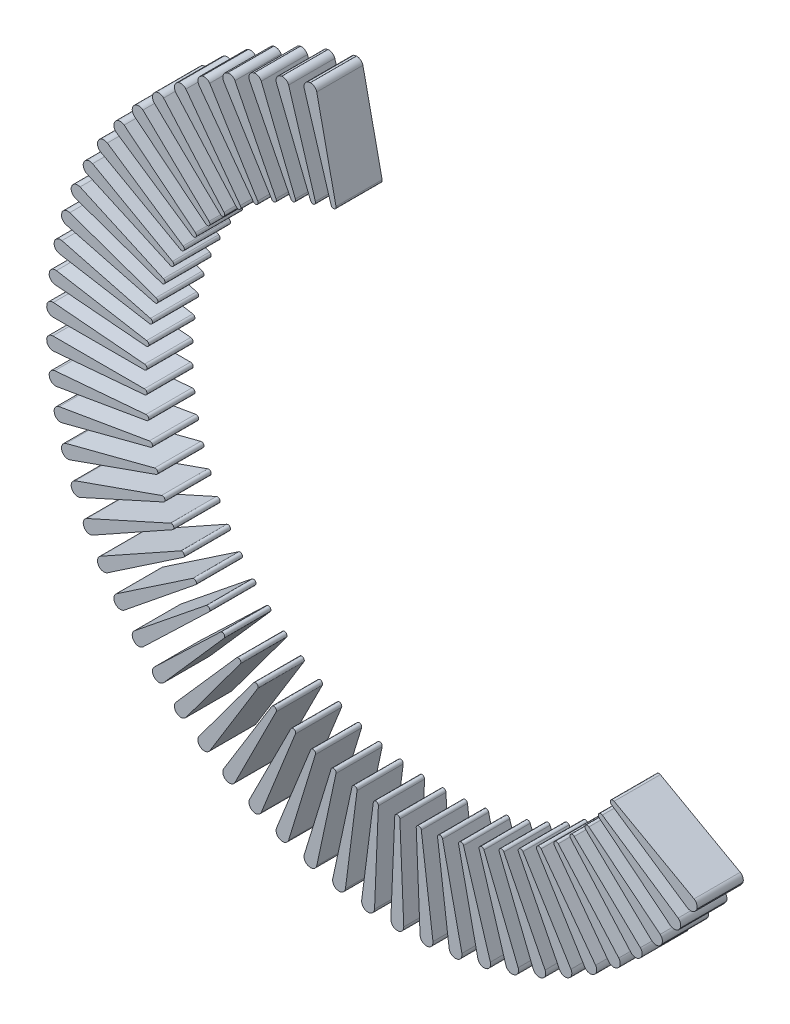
from build123d import *

# Parameters (mm, degrees)
P_IDAT_VYSUNUT_M1_DEPTH  = 10
M_TKO1_SCALE             = 0.655
ODEBRAT_VYSUNUT_M1_DEPTH = 71.666349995


with BuildPart() as part:
    # Skica1 → P_idat vysunut_m1 (new body)
    with BuildSketch(Plane.XY):
        with BuildLine():
            Line((0.319329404, 75.987034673), (-0.000670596, 75.987034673))
            Line((-0.000670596, 75.987034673), (-0.320670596, 75.987034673))
            Line((-0.320670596, 75.987034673), (-0.320670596, 75.977034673))
            ThreePointArc((-0.320670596, 75.977034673), (-1.097939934, 75.483579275), (-1.400670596, 74.61409667))
            Line((-1.400670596, 74.61409667), (-0.550670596, 54.81409667))
            ThreePointArc((-0.550670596, 54.81409667), (-0.000670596, 54.26409667), (0.549329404, 54.81409667))
            Line((0.549329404, 54.81409667), (1.399329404, 74.61409667))
            ThreePointArc((1.399329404, 74.61409667), (1.096598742, 75.483579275), (0.319329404, 75.977034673))
            Line((0.319329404, 75.977034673), (0.319329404, 75.987034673))
        make_face()
        with BuildLine():
            ThreePointArc((6.123787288, 75.730521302), (5.30747013, 75.304760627), (4.932092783, 74.464083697))
            Line((4.932092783, 74.464083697), (4.099873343, 54.663328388))
            ThreePointArc((4.099873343, 54.663328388), (4.601248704, 54.068666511), (5.195910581, 54.570041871))
            Line((5.195910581, 54.570041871), (7.722005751, 74.226627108))
            ThreePointArc((7.722005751, 74.226627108), (7.494102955, 75.118650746), (6.76148168, 75.67624551))
            Line((6.76148168, 75.67624551), (6.76232974, 75.686209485))
            Line((6.76232974, 75.686209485), (6.124635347, 75.740485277))
            Line((6.124635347, 75.740485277), (6.123787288, 75.730521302))
        make_face()
        with BuildLine():
            ThreePointArc((12.524123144, 74.938367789), (11.674639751, 74.583369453), (11.22932032, 73.777555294))
            Line((11.22932032, 73.777555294), (8.720877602, 54.118709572))
            ThreePointArc((8.720877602, 54.118709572), (9.170015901, 53.48367037), (9.805055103, 53.93280867))
            Line((9.805055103, 53.93280867), (13.989044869, 73.304352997))
            ThreePointArc((13.989044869, 73.304352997), (13.837611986, 74.212490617), (13.154917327, 74.830207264))
            Line((13.154917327, 74.830207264), (13.156607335, 74.840063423))
            Line((13.156607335, 74.840063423), (12.525813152, 74.948223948))
            Line((12.525813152, 74.948223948), (12.524123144, 74.938367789))
        make_face()
        with BuildLine():
            ThreePointArc((18.834222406, 73.606281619), (17.957693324, 73.324603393), (17.445640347, 72.559457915))
            Line((17.445640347, 72.559457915), (13.279047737, 53.184164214))
            ThreePointArc((13.279047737, 53.184164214), (13.672712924, 52.513323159), (14.343553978, 52.906988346))
            Line((14.343553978, 52.906988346), (20.155292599, 71.853919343))
            ThreePointArc((20.155292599, 71.853919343), (20.081420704, 72.771627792), (19.453571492, 73.44501566))
            Line((19.453571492, 73.44501566), (19.456091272, 73.454692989))
            Line((19.456091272, 73.454692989), (18.836742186, 73.615958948))
            Line((18.836742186, 73.615958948), (18.834222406, 73.606281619))
        make_face()
        with BuildLine():
            ThreePointArc((25.008620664, 71.743860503), (24.111361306, 71.537531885), (23.536264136, 70.818567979))
            Line((23.536264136, 70.818567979), (17.741542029, 51.866425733))
            ThreePointArc((17.741542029, 51.866425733), (18.076897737, 51.164616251), (18.778707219, 51.499971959))
            Line((18.778707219, 51.499971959), (26.176320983, 69.885776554))
            ThreePointArc((26.176320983, 69.885776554), (26.180542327, 70.806443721), (25.612062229, 71.530651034))
            Line((25.612062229, 71.530651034), (25.615393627, 71.540079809))
            Line((25.615393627, 71.540079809), (25.011952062, 71.753289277))
            Line((25.011952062, 71.753289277), (25.008620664, 71.743860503))
        make_face()
        with BuildLine():
            ThreePointArc((31.002831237, 69.364523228), (30.091306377, 69.235030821), (29.457308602, 68.567428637))
            Line((29.457308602, 68.567428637), (22.076208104, 50.174988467))
            ThreePointArc((22.076208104, 50.174988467), (22.350838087, 49.447267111), (23.078559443, 49.721897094))
            Line((23.078559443, 49.721897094), (32.008748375, 67.414105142))
            ThreePointArc((32.008748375, 67.414105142), (32.091032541, 68.331097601), (31.58601747, 69.100906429))
            Line((31.58601747, 69.100906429), (31.590136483, 69.110018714))
            Line((31.590136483, 69.110018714), (31.006950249, 69.373635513))
            Line((31.006950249, 69.373635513), (31.002831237, 69.364523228))
        make_face()
        with BuildLine():
            ThreePointArc((36.7736657, 66.485412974), (35.854442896, 66.433689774), (35.166112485, 65.822259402))
            Line((35.166112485, 65.822259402), (26.251814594, 48.122039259))
            ThreePointArc((26.251814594, 48.122039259), (26.463740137, 47.373649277), (27.212130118, 47.585574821))
            Line((27.212130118, 47.585574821), (37.610552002, 64.456713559))
            ThreePointArc((37.610552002, 64.456713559), (37.770306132, 65.363424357), (37.332394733, 66.17328821))
            Line((37.332394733, 66.17328821), (37.337271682, 66.182018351))
            Line((37.337271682, 66.182018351), (36.77854265, 66.494143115))
            Line((36.77854265, 66.494143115), (36.7736657, 66.485412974))
        make_face()
        with BuildLine():
            ThreePointArc((42.279545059, 63.127273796), (41.359247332, 63.153692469), (40.621543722, 62.602839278))
            Line((40.621543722, 62.602839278), (30.238276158, 45.722369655))
            ThreePointArc((30.238276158, 45.722369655), (30.385970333, 44.958703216), (31.149636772, 45.10639739))
            Line((31.149636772, 45.10639739), (42.941370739, 61.034909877))
            ThreePointArc((42.941370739, 61.034909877), (43.1774438, 61.924806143), (42.809791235, 62.768889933))
            Line((42.809791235, 62.768889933), (42.815390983, 62.77717503))
            Line((42.815390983, 62.77717503), (42.285144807, 63.135558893))
            Line((42.285144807, 63.135558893), (42.279545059, 63.127273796))
        make_face()
        with BuildLine():
            ThreePointArc((47.480799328, 59.314301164), (46.566057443, 59.418671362), (45.784295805, 58.932364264))
            Line((45.784295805, 58.932364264), (34.006870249, 42.993269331))
            ThreePointArc((34.006870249, 42.993269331), (34.089268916, 42.219828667), (34.862709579, 42.302227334))
            Line((34.862709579, 42.302227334), (47.962795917, 57.173348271))
            ThreePointArc((47.962795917, 57.173348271), (48.273486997, 58.040018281), (47.978742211, 58.912240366))
            Line((47.978742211, 58.912240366), (47.985024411, 58.920020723))
            Line((47.985024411, 58.920020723), (47.487081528, 59.322081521))
            Line((47.487081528, 59.322081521), (47.480799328, 59.314301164))
        make_face()
        with BuildLine():
            ThreePointArc((52.339953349, 55.073967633), (51.437358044, 55.255537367), (50.617170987, 54.837280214))
            Line((50.617170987, 54.837280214), (37.530444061, 39.954401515))
            ThreePointArc((37.530444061, 39.954401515), (37.546953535, 39.176759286), (38.324595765, 39.193268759))
            Line((38.324595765, 39.193268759), (52.63864805, 52.899851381))
            ThreePointArc((52.63864805, 52.899851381), (53.021718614, 53.737050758), (52.802005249, 54.631126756))
            Line((52.802005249, 54.631126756), (52.808924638, 54.638346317))
            Line((52.808924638, 54.638346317), (52.346872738, 55.081187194))
            Line((52.346872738, 55.081187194), (52.339953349, 55.073967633))
        make_face()
        with BuildLine():
            ThreePointArc((56.821996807, 50.436824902), (55.938051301, 50.694285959), (55.085348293, 50.347092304))
            Line((55.085348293, 50.347092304), (40.783610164, 36.627661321))
            ThreePointArc((40.783610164, 36.627661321), (40.734111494, 35.851420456), (41.51035236, 35.801921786))
            Line((41.51035236, 35.801921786), (56.935237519, 48.245209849))
            ThreePointArc((56.935237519, 48.245209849), (57.387927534, 49.046906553), (57.24482863, 49.956394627))
            Line((57.24482863, 49.956394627), (57.252335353, 49.963001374))
            Line((57.252335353, 49.963001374), (56.82950353, 50.44343165))
            Line((56.82950353, 50.44343165), (56.821996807, 50.436824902))
        make_face()
        with BuildLine():
            ThreePointArc((60.894636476, 45.436283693), (60.035709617, 45.767781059), (59.156634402, 45.49415244))
            Line((59.156634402, 45.49415244), (43.742929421, 33.037017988))
            ThreePointArc((43.742929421, 33.037017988), (43.627779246, 32.26777132), (44.397025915, 32.152621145))
            Line((44.397025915, 32.152621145), (60.821607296, 43.242960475))
            ThreePointArc((60.821607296, 43.242960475), (61.34065512, 44.003378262), (61.275201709, 44.92172553))
            Line((61.275201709, 44.92172553), (61.28324168, 44.927671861))
            Line((61.28324168, 44.927671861), (60.902676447, 45.442230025))
            Line((60.902676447, 45.442230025), (60.894636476, 45.436283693))
        make_face()
        with BuildLine():
            ThreePointArc((64.528528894, 40.108373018), (63.700809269, 40.511518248), (62.801695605, 40.313426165))
            Line((62.801695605, 40.313426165), (46.387079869, 29.208342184))
            ThreePointArc((46.387079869, 29.208342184), (46.207107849, 28.451632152), (46.963817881, 28.271660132))
            Line((46.963817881, 28.271660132), (64.269755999, 37.92914458))
            ThreePointArc((64.269755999, 37.92914458), (64.851421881, 38.642804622), (64.864085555, 39.56339437))
            Line((64.864085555, 39.56339437), (64.872600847, 39.568637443))
            Line((64.872600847, 39.568637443), (64.537044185, 40.113616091))
            Line((64.537044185, 40.113616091), (64.528528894, 40.108373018))
        make_face()
        with BuildLine():
            ThreePointArc((67.697491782, 34.491480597), (66.906943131, 34.96336902), (65.994269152, 34.842240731))
            Line((65.994269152, 34.842240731), (48.697010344, 25.169219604))
            ThreePointArc((48.697010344, 25.169219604), (48.453513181, 24.430498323), (49.192234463, 24.18700116))
            Line((49.192234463, 24.18700116), (67.254839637, 32.342048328))
            ThreePointArc((67.254839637, 32.342048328), (67.894932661, 33.003808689), (67.985622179, 33.920008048))
            Line((67.985622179, 33.920008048), (67.994551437, 33.924510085))
            Line((67.994551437, 33.924510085), (67.706421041, 34.495982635))
            Line((67.706421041, 34.495982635), (67.697491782, 34.491480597))
        make_face()
        with BuildLine():
            ThreePointArc((70.378692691, 28.626076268), (69.631010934, 29.163307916), (68.711352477, 29.120016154))
            Line((68.711352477, 29.120016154), (50.656077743, 20.948752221))
            ThreePointArc((50.656077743, 20.948752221), (50.35080984, 20.233342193), (51.066219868, 19.928074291))
            Line((51.066219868, 19.928074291), (69.755350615, 26.521926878))
            ThreePointArc((69.755350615, 26.521926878), (70.449258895, 27.127019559), (70.617320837, 28.03222729))
            Line((70.617320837, 28.03222729), (70.626599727, 28.035955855))
            Line((70.626599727, 28.035955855), (70.387971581, 28.629804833))
            Line((70.387971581, 28.629804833), (70.378692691, 28.626076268))
        make_face()
        with BuildLine():
            ThreePointArc((72.552813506, 22.554420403), (71.853385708, 23.153124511), (70.933368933, 23.187981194))
            Line((70.933368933, 23.187981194), (52.250166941, 16.577348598))
            ThreePointArc((52.250166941, 16.577348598), (51.885327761, 15.890404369), (52.572271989, 15.52556519))
            Line((52.572271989, 15.52556519), (71.753272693, 20.510714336))
            ThreePointArc((71.753272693, 20.510714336), (72.495996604, 21.054779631), (72.74022008, 21.942473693))
            Line((72.74022008, 21.942473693), (72.749781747, 21.945401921))
            Line((72.749781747, 21.945401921), (72.562375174, 22.557348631))
            Line((72.562375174, 22.557348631), (72.552813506, 22.554420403))
        make_face()
        with BuildLine():
            ThreePointArc((74.204189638, 16.320259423), (73.558055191, 16.976122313), (72.644308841, 17.088876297))
            Line((72.644308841, 17.088876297), (53.467792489, 12.086504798))
            ThreePointArc((53.467792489, 12.086504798), (53.046010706, 11.432975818), (53.699539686, 11.011194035))
            Line((53.699539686, 11.011194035), (73.234210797, 14.351721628))
            ThreePointArc((73.234210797, 14.351721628), (74.020398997, 14.830839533), (74.33902437, 15.69462407))
            Line((74.33902437, 15.69462407), (74.348799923, 15.696730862))
            Line((74.348799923, 15.696730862), (74.21396519, 16.322366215))
            Line((74.21396519, 16.322366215), (74.204189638, 16.320259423))
        make_face()
        with BuildLine():
            ThreePointArc((75.320922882, 9.968510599), (74.732737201, 10.676806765), (73.831844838, 10.866645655))
            Line((73.831844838, 10.866645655), (54.300181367, 7.508577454))
            ThreePointArc((54.300181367, 7.508577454), (53.824495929, 6.893172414), (54.439900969, 6.417486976))
            Line((54.439900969, 6.417486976), (74.187494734, 8.089324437))
            ThreePointArc((74.187494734, 8.089324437), (75.011482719, 8.500042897), (75.402214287, 9.33369432))
            Line((75.402214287, 9.33369432), (75.412133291, 9.334964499))
            Line((75.412133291, 9.334964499), (75.330841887, 9.969780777))
            Line((75.330841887, 9.969780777), (75.320922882, 9.968510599))
        make_face()
        with BuildLine():
            ThreePointArc((75.894967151, 3.544938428), (75.368968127, 4.300564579), (74.487420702, 4.566120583))
            Line((74.487420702, 4.566120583), (54.741336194, 2.876550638))
            ThreePointArc((54.741336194, 2.876550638), (54.215174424, 2.303703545), (54.788021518, 1.777541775))
            Line((54.788021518, 1.777541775), (74.606256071, 1.768643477))
            ThreePointArc((74.606256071, 1.768643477), (75.462106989, 2.108003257), (75.922129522, 2.905515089))
            Line((75.922129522, 2.905515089), (75.932120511, 2.905939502))
            Line((75.932120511, 2.905939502), (75.904958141, 3.54536284))
            Line((75.904958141, 3.54536284), (75.894967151, 3.544938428))
        make_face()
        with BuildLine():
            ThreePointArc((75.922186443, -2.904175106), (75.462163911, -2.106663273), (74.606312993, -1.767303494))
            Line((74.606312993, -1.767303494), (54.788078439, -1.776201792))
            ThreePointArc((54.788078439, -1.776201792), (54.215231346, -2.302363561), (54.741393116, -2.875210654))
            Line((54.741393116, -2.875210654), (74.487477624, -4.564780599))
            ThreePointArc((74.487477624, -4.564780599), (75.369025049, -4.299224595), (75.895024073, -3.543598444))
            Line((75.895024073, -3.543598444), (75.905015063, -3.544022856))
            Line((75.905015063, -3.544022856), (75.932177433, -2.904599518))
            Line((75.932177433, -2.904599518), (75.922186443, -2.904175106))
        make_face()
        with BuildLine():
            ThreePointArc((75.402384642, -9.332363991), (75.011653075, -8.498712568), (74.187665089, -8.087994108))
            Line((74.187665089, -8.087994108), (54.440071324, -6.416156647))
            ThreePointArc((54.440071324, -6.416156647), (53.824666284, -6.891842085), (54.300351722, -7.507247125))
            Line((54.300351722, -7.507247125), (73.832015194, -10.865315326))
            ThreePointArc((73.832015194, -10.865315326), (74.732907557, -10.675476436), (75.321093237, -9.96718027))
            Line((75.321093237, -9.96718027), (75.331012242, -9.968450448))
            Line((75.331012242, -9.968450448), (75.412303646, -9.333634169))
            Line((75.412303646, -9.333634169), (75.402384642, -9.332363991))
        make_face()
        with BuildLine():
            ThreePointArc((74.339306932, -15.69331298), (74.020681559, -14.829528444), (73.234493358, -14.350410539))
            Line((73.234493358, -14.350410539), (53.699822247, -11.009882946))
            ThreePointArc((53.699822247, -11.009882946), (53.046293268, -11.431664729), (53.46807505, -12.085193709))
            Line((53.46807505, -12.085193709), (72.644591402, -17.087565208))
            ThreePointArc((72.644591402, -17.087565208), (73.558337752, -16.974811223), (74.204472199, -16.318948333))
            Line((74.204472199, -16.318948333), (74.214247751, -16.321055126))
            Line((74.214247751, -16.321055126), (74.349082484, -15.695419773))
            Line((74.349082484, -15.695419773), (74.339306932, -15.69331298))
        make_face()
        with BuildLine():
            ThreePointArc((72.740612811, -21.94119129), (72.496389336, -21.053497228), (71.753665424, -20.509431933))
            Line((71.753665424, -20.509431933), (52.572664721, -15.524282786))
            ThreePointArc((52.572664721, -15.524282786), (51.885720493, -15.889121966), (52.250559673, -16.576066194))
            Line((52.250559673, -16.576066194), (70.933761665, -23.18669879))
            ThreePointArc((70.933761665, -23.18669879), (71.853778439, -23.151842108), (72.553206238, -22.553138))
            Line((72.553206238, -22.553138), (72.562767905, -22.556066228))
            Line((72.562767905, -22.556066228), (72.750174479, -21.944119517))
            Line((72.750174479, -21.944119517), (72.740612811, -21.94119129))
        make_face()
        with BuildLine():
            ThreePointArc((70.617820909, -28.030982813), (70.449758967, -27.125775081), (69.755850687, -26.5206824))
            Line((69.755850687, -26.5206824), (51.06671994, -19.926829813))
            ThreePointArc((51.06671994, -19.926829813), (50.351309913, -20.232097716), (50.656577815, -20.947507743))
            Line((50.656577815, -20.947507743), (68.711852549, -29.118771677))
            ThreePointArc((68.711852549, -29.118771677), (69.631511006, -29.162063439), (70.379192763, -28.62483179))
            Line((70.379192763, -28.62483179), (70.388471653, -28.628560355))
            Line((70.388471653, -28.628560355), (70.627099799, -28.034711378))
            Line((70.627099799, -28.034711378), (70.617820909, -28.030982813))
        make_face()
        with BuildLine():
            ThreePointArc((67.986225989, -33.918810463), (67.89553647, -33.002611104), (67.255443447, -32.340850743))
            Line((67.255443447, -32.340850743), (49.192838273, -24.185803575))
            ThreePointArc((49.192838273, -24.185803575), (48.454116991, -24.429300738), (48.697614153, -25.168022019))
            Line((48.697614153, -25.168022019), (65.994872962, -34.841043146))
            ThreePointArc((65.994872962, -34.841043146), (66.90754694, -34.962171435), (67.698095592, -34.490283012))
            Line((67.698095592, -34.490283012), (67.70702485, -34.49478505))
            Line((67.70702485, -34.49478505), (67.995155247, -33.9233125))
            Line((67.995155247, -33.9233125), (67.986225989, -33.918810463))
        make_face()
        with BuildLine():
            ThreePointArc((64.864788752, -39.562252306), (64.852125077, -38.641662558), (64.270459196, -37.928002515))
            Line((64.270459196, -37.928002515), (46.964521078, -28.270518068))
            ThreePointArc((46.964521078, -28.270518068), (46.207811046, -28.450490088), (46.387783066, -29.20720012))
            Line((46.387783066, -29.20720012), (62.802398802, -40.312284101))
            ThreePointArc((62.802398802, -40.312284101), (63.701512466, -40.510376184), (64.529232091, -40.107230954))
            Line((64.529232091, -40.107230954), (64.537747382, -40.112474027))
            Line((64.537747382, -40.112474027), (64.873304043, -39.567495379))
            Line((64.873304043, -39.567495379), (64.864788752, -39.562252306))
        make_face()
        with BuildLine():
            ThreePointArc((61.275999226, -44.920647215), (61.341452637, -44.002299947), (60.822404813, -43.24188216))
            Line((60.822404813, -43.24188216), (44.397823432, -32.15154283))
            ThreePointArc((44.397823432, -32.15154283), (43.628576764, -32.266693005), (43.743726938, -33.035939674))
            Line((43.743726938, -33.035939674), (59.15743192, -45.493074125))
            ThreePointArc((59.15743192, -45.493074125), (60.036507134, -45.766702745), (60.895433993, -45.435205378))
            Line((60.895433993, -45.435205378), (60.903473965, -45.44115171))
            Line((60.903473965, -45.44115171), (61.284039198, -44.926593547))
            Line((61.284039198, -44.926593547), (61.275999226, -44.920647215))
        make_face()
        with BuildLine():
            ThreePointArc((57.245714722, -49.955387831), (57.388813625, -49.045899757), (56.936123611, -48.244203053))
            Line((56.936123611, -48.244203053), (41.511238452, -35.80091499))
            ThreePointArc((41.511238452, -35.80091499), (40.734997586, -35.85041366), (40.784496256, -36.626654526))
            Line((40.784496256, -36.626654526), (55.086234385, -50.346085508))
            ThreePointArc((55.086234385, -50.346085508), (55.938937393, -50.693279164), (56.822882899, -50.435818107))
            Line((56.822882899, -50.435818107), (56.830389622, -50.442424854))
            Line((56.830389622, -50.442424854), (57.253221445, -49.961994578))
            Line((57.253221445, -49.961994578), (57.245714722, -49.955387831))
        make_face()
        with BuildLine():
            ThreePointArc((52.802973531, -54.630198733), (53.022686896, -53.736122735), (52.639616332, -52.898923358))
            Line((52.639616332, -52.898923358), (38.325564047, -39.192340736))
            ThreePointArc((38.325564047, -39.192340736), (37.547921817, -39.175831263), (37.531412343, -39.953473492))
            Line((37.531412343, -39.953473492), (50.618139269, -54.836352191))
            ThreePointArc((50.618139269, -54.836352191), (51.438326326, -55.254609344), (52.340921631, -55.07303961))
            Line((52.340921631, -55.07303961), (52.34784102, -55.080259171))
            Line((52.34784102, -55.080259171), (52.80989292, -54.637418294))
            Line((52.80989292, -54.637418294), (52.802973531, -54.630198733))
        make_face()
        with BuildLine():
            ThreePointArc((47.979785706, -58.911397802), (48.274530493, -58.039175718), (47.963839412, -57.172505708))
            Line((47.963839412, -57.172505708), (34.863753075, -42.30138477))
            ThreePointArc((34.863753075, -42.30138477), (34.090312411, -42.218986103), (34.007913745, -42.992426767))
            Line((34.007913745, -42.992426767), (45.7853393, -58.9315217))
            ThreePointArc((45.7853393, -58.9315217), (46.567100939, -59.417828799), (47.481842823, -59.3134586))
            Line((47.481842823, -59.3134586), (47.488125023, -59.321238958))
            Line((47.488125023, -59.321238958), (47.986067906, -58.919178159))
            Line((47.986067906, -58.919178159), (47.979785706, -58.911397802))
        make_face()
        with BuildLine():
            ThreePointArc((42.810902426, -62.768138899), (43.178554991, -61.924055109), (42.94248193, -61.034158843))
            Line((42.94248193, -61.034158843), (31.150747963, -45.105646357))
            ThreePointArc((31.150747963, -45.105646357), (30.387081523, -44.957952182), (30.239387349, -45.721618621))
            Line((30.239387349, -45.721618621), (40.622654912, -62.602088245))
            ThreePointArc((40.622654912, -62.602088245), (41.360358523, -63.152941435), (42.28065625, -63.126522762))
            Line((42.28065625, -63.126522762), (42.286255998, -63.134807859))
            Line((42.286255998, -63.134807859), (42.816502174, -62.776423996))
            Line((42.816502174, -62.776423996), (42.810902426, -62.768138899))
        make_face()
        with BuildLine():
            ThreePointArc((37.333565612, -66.172634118), (37.771477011, -65.362770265), (37.611722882, -64.456059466))
            Line((37.611722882, -64.456059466), (27.213300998, -47.584920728))
            ThreePointArc((27.213300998, -47.584920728), (26.464911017, -47.372995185), (26.252985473, -48.121385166))
            Line((26.252985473, -48.121385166), (35.167283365, -65.821605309))
            ThreePointArc((35.167283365, -65.821605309), (35.855613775, -66.433035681), (36.77483658, -66.484758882))
            Line((36.77483658, -66.484758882), (36.779713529, -66.493489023))
            Line((36.779713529, -66.493489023), (37.338442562, -66.181364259))
            Line((37.338442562, -66.181364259), (37.333565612, -66.172634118))
        make_face()
        with BuildLine():
            ThreePointArc((31.587239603, -69.100353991), (32.092254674, -68.330545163), (32.009970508, -67.413552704))
            Line((32.009970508, -67.413552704), (23.079781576, -49.721344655))
            ThreePointArc((23.079781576, -49.721344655), (22.35206022, -49.446714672), (22.077430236, -50.174436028))
            Line((22.077430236, -50.174436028), (29.458530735, -68.566876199))
            ThreePointArc((29.458530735, -68.566876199), (30.092528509, -69.234478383), (31.004053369, -69.36397079))
            Line((31.004053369, -69.36397079), (31.008172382, -69.373083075))
            Line((31.008172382, -69.373083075), (31.591358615, -69.109466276))
            Line((31.591358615, -69.109466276), (31.587239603, -69.100353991))
        make_face()
        with BuildLine():
            ThreePointArc((25.613326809, -71.53020423), (26.181806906, -70.805996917), (26.177585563, -69.885329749))
            Line((26.177585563, -69.885329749), (18.779971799, -51.499525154))
            ThreePointArc((18.779971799, -51.499525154), (18.078162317, -51.164169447), (17.742806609, -51.865978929))
            Line((17.742806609, -51.865978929), (23.537528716, -70.818121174))
            ThreePointArc((23.537528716, -70.818121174), (24.112625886, -71.537085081), (25.009885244, -71.743413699))
            Line((25.009885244, -71.743413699), (25.013216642, -71.752842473))
            Line((25.013216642, -71.752842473), (25.616658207, -71.539633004))
            Line((25.616658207, -71.539633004), (25.613326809, -71.53020423))
        make_face()
        with BuildLine():
            ThreePointArc((19.454869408, -73.444677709), (20.08271862, -72.771289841), (20.156590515, -71.853581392))
            Line((20.156590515, -71.853581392), (14.344851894, -52.906650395))
            ThreePointArc((14.344851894, -52.906650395), (13.67401084, -52.512985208), (13.280345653, -53.183826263))
            Line((13.280345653, -53.183826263), (17.446938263, -72.559119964))
            ThreePointArc((17.446938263, -72.559119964), (17.95899124, -73.324265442), (18.835520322, -73.605943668))
            Line((18.835520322, -73.605943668), (18.838040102, -73.615620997))
            Line((18.838040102, -73.615620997), (19.457389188, -73.454355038))
            Line((19.457389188, -73.454355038), (19.454869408, -73.444677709))
        make_face()
        with BuildLine():
            ThreePointArc((13.156239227, -74.829980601), (13.838933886, -74.212263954), (13.99036677, -73.304126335))
            Line((13.99036677, -73.304126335), (9.806377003, -53.932582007))
            ThreePointArc((9.806377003, -53.932582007), (9.171337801, -53.483443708), (8.722199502, -54.118482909))
            Line((8.722199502, -54.118482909), (11.230642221, -73.777328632))
            ThreePointArc((11.230642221, -73.777328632), (11.675961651, -74.58314279), (12.525445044, -74.938141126))
            Line((12.525445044, -74.938141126), (12.527135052, -74.947997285))
            Line((12.527135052, -74.947997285), (13.157929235, -74.83983676))
            Line((13.157929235, -74.83983676), (13.156239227, -74.829980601))
        make_face()
        with BuildLine():
            ThreePointArc((6.762818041, -75.676131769), (7.495439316, -75.118537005), (7.723342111, -74.226513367))
            Line((7.723342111, -74.226513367), (5.197246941, -54.56992813))
            ThreePointArc((5.197246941, -54.56992813), (4.602585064, -54.06855277), (4.101209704, -54.663214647))
            Line((4.101209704, -54.663214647), (4.933429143, -74.463969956))
            ThreePointArc((4.933429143, -74.463969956), (5.308806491, -75.304646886), (6.125123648, -75.730407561))
            Line((6.125123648, -75.730407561), (6.125971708, -75.740371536))
            Line((6.125971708, -75.740371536), (6.7636661, -75.686095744))
            Line((6.7636661, -75.686095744), (6.762818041, -75.676131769))
        make_face()
        with BuildLine():
            ThreePointArc((0.320670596, -75.977034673), (1.097939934, -75.483579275), (1.400670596, -74.61409667))
            Line((1.400670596, -74.61409667), (0.550670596, -54.81409667))
            ThreePointArc((0.550670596, -54.81409667), (0.000670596, -54.26409667), (-0.549329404, -54.81409667))
            Line((-0.549329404, -54.81409667), (-1.399329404, -74.61409667))
            ThreePointArc((-1.399329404, -74.61409667), (-1.096598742, -75.483579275), (-0.319329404, -75.977034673))
            Line((-0.319329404, -75.977034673), (-0.319329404, -75.987034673))
            Line((-0.319329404, -75.987034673), (0.320670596, -75.987034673))
            Line((0.320670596, -75.987034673), (0.320670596, -75.977034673))
        make_face()
        with BuildLine():
            ThreePointArc((-6.123787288, -75.730521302), (-5.30747013, -75.304760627), (-4.932092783, -74.464083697))
            Line((-4.932092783, -74.464083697), (-4.099873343, -54.663328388))
            ThreePointArc((-4.099873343, -54.663328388), (-4.601248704, -54.068666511), (-5.195910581, -54.570041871))
            Line((-5.195910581, -54.570041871), (-7.722005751, -74.226627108))
            ThreePointArc((-7.722005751, -74.226627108), (-7.494102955, -75.118650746), (-6.76148168, -75.67624551))
            Line((-6.76148168, -75.67624551), (-6.76232974, -75.686209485))
            Line((-6.76232974, -75.686209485), (-6.124635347, -75.740485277))
            Line((-6.124635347, -75.740485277), (-6.123787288, -75.730521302))
        make_face()
        with BuildLine():
            ThreePointArc((-12.524123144, -74.938367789), (-11.674639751, -74.583369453), (-11.22932032, -73.777555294))
            Line((-11.22932032, -73.777555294), (-8.720877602, -54.118709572))
            ThreePointArc((-8.720877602, -54.118709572), (-9.170015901, -53.48367037), (-9.805055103, -53.93280867))
            Line((-9.805055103, -53.93280867), (-13.989044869, -73.304352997))
            ThreePointArc((-13.989044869, -73.304352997), (-13.837611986, -74.212490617), (-13.154917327, -74.830207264))
            Line((-13.154917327, -74.830207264), (-13.156607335, -74.840063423))
            Line((-13.156607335, -74.840063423), (-12.525813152, -74.948223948))
            Line((-12.525813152, -74.948223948), (-12.524123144, -74.938367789))
        make_face()
        with BuildLine():
            ThreePointArc((-18.834222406, -73.606281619), (-17.957693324, -73.324603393), (-17.445640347, -72.559457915))
            Line((-17.445640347, -72.559457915), (-13.279047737, -53.184164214))
            ThreePointArc((-13.279047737, -53.184164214), (-13.672712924, -52.513323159), (-14.343553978, -52.906988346))
            Line((-14.343553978, -52.906988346), (-20.155292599, -71.853919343))
            ThreePointArc((-20.155292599, -71.853919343), (-20.081420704, -72.771627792), (-19.453571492, -73.44501566))
            Line((-19.453571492, -73.44501566), (-19.456091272, -73.454692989))
            Line((-19.456091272, -73.454692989), (-18.836742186, -73.615958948))
            Line((-18.836742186, -73.615958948), (-18.834222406, -73.606281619))
        make_face()
        with BuildLine():
            ThreePointArc((-25.008620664, -71.743860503), (-24.111361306, -71.537531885), (-23.536264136, -70.818567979))
            Line((-23.536264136, -70.818567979), (-17.741542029, -51.866425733))
            ThreePointArc((-17.741542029, -51.866425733), (-18.076897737, -51.164616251), (-18.778707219, -51.499971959))
            Line((-18.778707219, -51.499971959), (-26.176320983, -69.885776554))
            ThreePointArc((-26.176320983, -69.885776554), (-26.180542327, -70.806443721), (-25.612062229, -71.530651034))
            Line((-25.612062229, -71.530651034), (-25.615393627, -71.540079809))
            Line((-25.615393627, -71.540079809), (-25.011952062, -71.753289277))
            Line((-25.011952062, -71.753289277), (-25.008620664, -71.743860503))
        make_face()
        with BuildLine():
            ThreePointArc((-31.002831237, -69.364523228), (-30.091306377, -69.235030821), (-29.457308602, -68.567428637))
            Line((-29.457308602, -68.567428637), (-22.076208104, -50.174988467))
            ThreePointArc((-22.076208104, -50.174988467), (-22.350838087, -49.447267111), (-23.078559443, -49.721897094))
            Line((-23.078559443, -49.721897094), (-32.008748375, -67.414105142))
            ThreePointArc((-32.008748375, -67.414105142), (-32.091032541, -68.331097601), (-31.58601747, -69.100906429))
            Line((-31.58601747, -69.100906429), (-31.590136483, -69.110018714))
            Line((-31.590136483, -69.110018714), (-31.006950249, -69.373635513))
            Line((-31.006950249, -69.373635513), (-31.002831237, -69.364523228))
        make_face()
        with BuildLine():
            ThreePointArc((-36.7736657, -66.485412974), (-35.854442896, -66.433689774), (-35.166112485, -65.822259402))
            Line((-35.166112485, -65.822259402), (-26.251814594, -48.122039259))
            ThreePointArc((-26.251814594, -48.122039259), (-26.463740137, -47.373649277), (-27.212130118, -47.585574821))
            Line((-27.212130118, -47.585574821), (-37.610552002, -64.456713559))
            ThreePointArc((-37.610552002, -64.456713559), (-37.770306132, -65.363424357), (-37.332394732, -66.17328821))
            Line((-37.332394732, -66.17328821), (-37.337271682, -66.182018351))
            Line((-37.337271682, -66.182018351), (-36.778542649, -66.494143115))
            Line((-36.778542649, -66.494143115), (-36.7736657, -66.485412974))
        make_face()
        with BuildLine():
            ThreePointArc((-42.279545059, -63.127273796), (-41.359247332, -63.153692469), (-40.621543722, -62.602839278))
            Line((-40.621543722, -62.602839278), (-30.238276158, -45.722369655))
            ThreePointArc((-30.238276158, -45.722369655), (-30.385970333, -44.958703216), (-31.149636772, -45.10639739))
            Line((-31.149636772, -45.10639739), (-42.941370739, -61.034909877))
            ThreePointArc((-42.941370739, -61.034909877), (-43.1774438, -61.924806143), (-42.809791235, -62.768889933))
            Line((-42.809791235, -62.768889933), (-42.815390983, -62.77717503))
            Line((-42.815390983, -62.77717503), (-42.285144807, -63.135558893))
            Line((-42.285144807, -63.135558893), (-42.279545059, -63.127273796))
        make_face()
        with BuildLine():
            ThreePointArc((-47.480799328, -59.314301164), (-46.566057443, -59.418671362), (-45.784295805, -58.932364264))
            Line((-45.784295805, -58.932364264), (-34.006870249, -42.993269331))
            ThreePointArc((-34.006870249, -42.993269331), (-34.089268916, -42.219828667), (-34.862709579, -42.302227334))
            Line((-34.862709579, -42.302227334), (-47.962795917, -57.173348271))
            ThreePointArc((-47.962795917, -57.173348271), (-48.273486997, -58.040018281), (-47.978742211, -58.912240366))
            Line((-47.978742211, -58.912240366), (-47.985024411, -58.920020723))
            Line((-47.985024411, -58.920020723), (-47.487081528, -59.322081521))
            Line((-47.487081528, -59.322081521), (-47.480799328, -59.314301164))
        make_face()
        with BuildLine():
            ThreePointArc((-52.339953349, -55.073967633), (-51.437358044, -55.255537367), (-50.617170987, -54.837280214))
            Line((-50.617170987, -54.837280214), (-37.530444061, -39.954401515))
            ThreePointArc((-37.530444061, -39.954401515), (-37.546953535, -39.176759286), (-38.324595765, -39.193268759))
            Line((-38.324595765, -39.193268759), (-52.63864805, -52.899851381))
            ThreePointArc((-52.63864805, -52.899851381), (-53.021718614, -53.737050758), (-52.802005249, -54.631126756))
            Line((-52.802005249, -54.631126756), (-52.808924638, -54.638346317))
            Line((-52.808924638, -54.638346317), (-52.346872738, -55.081187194))
            Line((-52.346872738, -55.081187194), (-52.339953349, -55.073967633))
        make_face()
        with BuildLine():
            ThreePointArc((-56.821996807, -50.436824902), (-55.938051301, -50.694285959), (-55.085348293, -50.347092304))
            Line((-55.085348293, -50.347092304), (-40.783610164, -36.627661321))
            ThreePointArc((-40.783610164, -36.627661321), (-40.734111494, -35.851420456), (-41.51035236, -35.801921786))
            Line((-41.51035236, -35.801921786), (-56.935237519, -48.245209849))
            ThreePointArc((-56.935237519, -48.245209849), (-57.387927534, -49.046906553), (-57.24482863, -49.956394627))
            Line((-57.24482863, -49.956394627), (-57.252335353, -49.963001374))
            Line((-57.252335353, -49.963001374), (-56.82950353, -50.44343165))
            Line((-56.82950353, -50.44343165), (-56.821996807, -50.436824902))
        make_face()
        with BuildLine():
            ThreePointArc((-60.894636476, -45.436283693), (-60.035709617, -45.767781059), (-59.156634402, -45.49415244))
            Line((-59.156634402, -45.49415244), (-43.742929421, -33.037017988))
            ThreePointArc((-43.742929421, -33.037017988), (-43.627779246, -32.26777132), (-44.397025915, -32.152621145))
            Line((-44.397025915, -32.152621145), (-60.821607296, -43.242960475))
            ThreePointArc((-60.821607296, -43.242960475), (-61.34065512, -44.003378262), (-61.275201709, -44.92172553))
            Line((-61.275201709, -44.92172553), (-61.28324168, -44.927671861))
            Line((-61.28324168, -44.927671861), (-60.902676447, -45.442230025))
            Line((-60.902676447, -45.442230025), (-60.894636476, -45.436283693))
        make_face()
        with BuildLine():
            ThreePointArc((-64.528528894, -40.108373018), (-63.700809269, -40.511518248), (-62.801695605, -40.313426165))
            Line((-62.801695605, -40.313426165), (-46.387079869, -29.208342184))
            ThreePointArc((-46.387079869, -29.208342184), (-46.207107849, -28.451632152), (-46.963817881, -28.271660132))
            Line((-46.963817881, -28.271660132), (-64.269755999, -37.92914458))
            ThreePointArc((-64.269755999, -37.92914458), (-64.851421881, -38.642804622), (-64.864085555, -39.56339437))
            Line((-64.864085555, -39.56339437), (-64.872600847, -39.568637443))
            Line((-64.872600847, -39.568637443), (-64.537044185, -40.113616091))
            Line((-64.537044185, -40.113616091), (-64.528528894, -40.108373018))
        make_face()
        with BuildLine():
            ThreePointArc((-67.697491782, -34.491480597), (-66.906943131, -34.96336902), (-65.994269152, -34.842240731))
            Line((-65.994269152, -34.842240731), (-48.697010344, -25.169219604))
            ThreePointArc((-48.697010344, -25.169219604), (-48.453513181, -24.430498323), (-49.192234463, -24.18700116))
            Line((-49.192234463, -24.18700116), (-67.254839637, -32.342048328))
            ThreePointArc((-67.254839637, -32.342048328), (-67.894932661, -33.003808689), (-67.985622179, -33.920008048))
            Line((-67.985622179, -33.920008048), (-67.994551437, -33.924510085))
            Line((-67.994551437, -33.924510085), (-67.706421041, -34.495982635))
            Line((-67.706421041, -34.495982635), (-67.697491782, -34.491480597))
        make_face()
        with BuildLine():
            ThreePointArc((-70.378692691, -28.626076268), (-69.631010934, -29.163307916), (-68.711352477, -29.120016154))
            Line((-68.711352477, -29.120016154), (-50.656077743, -20.948752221))
            ThreePointArc((-50.656077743, -20.948752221), (-50.35080984, -20.233342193), (-51.066219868, -19.928074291))
            Line((-51.066219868, -19.928074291), (-69.755350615, -26.521926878))
            ThreePointArc((-69.755350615, -26.521926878), (-70.449258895, -27.127019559), (-70.617320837, -28.03222729))
            Line((-70.617320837, -28.03222729), (-70.626599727, -28.035955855))
            Line((-70.626599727, -28.035955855), (-70.387971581, -28.629804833))
            Line((-70.387971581, -28.629804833), (-70.378692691, -28.626076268))
        make_face()
        with BuildLine():
            ThreePointArc((-72.552813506, -22.554420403), (-71.853385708, -23.153124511), (-70.933368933, -23.187981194))
            Line((-70.933368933, -23.187981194), (-52.250166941, -16.577348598))
            ThreePointArc((-52.250166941, -16.577348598), (-51.885327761, -15.890404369), (-52.572271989, -15.52556519))
            Line((-52.572271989, -15.52556519), (-71.753272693, -20.510714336))
            ThreePointArc((-71.753272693, -20.510714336), (-72.495996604, -21.054779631), (-72.74022008, -21.942473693))
            Line((-72.74022008, -21.942473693), (-72.749781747, -21.945401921))
            Line((-72.749781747, -21.945401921), (-72.562375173, -22.557348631))
            Line((-72.562375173, -22.557348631), (-72.552813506, -22.554420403))
        make_face()
        with BuildLine():
            ThreePointArc((-74.204189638, -16.320259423), (-73.558055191, -16.976122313), (-72.644308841, -17.088876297))
            Line((-72.644308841, -17.088876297), (-53.467792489, -12.086504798))
            ThreePointArc((-53.467792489, -12.086504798), (-53.046010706, -11.432975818), (-53.699539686, -11.011194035))
            Line((-53.699539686, -11.011194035), (-73.234210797, -14.351721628))
            ThreePointArc((-73.234210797, -14.351721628), (-74.020398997, -14.830839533), (-74.33902437, -15.69462407))
            Line((-74.33902437, -15.69462407), (-74.348799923, -15.696730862))
            Line((-74.348799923, -15.696730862), (-74.21396519, -16.322366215))
            Line((-74.21396519, -16.322366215), (-74.204189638, -16.320259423))
        make_face()
        with BuildLine():
            ThreePointArc((-75.320922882, -9.968510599), (-74.732737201, -10.676806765), (-73.831844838, -10.866645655))
            Line((-73.831844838, -10.866645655), (-54.300181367, -7.508577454))
            ThreePointArc((-54.300181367, -7.508577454), (-53.824495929, -6.893172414), (-54.439900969, -6.417486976))
            Line((-54.439900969, -6.417486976), (-74.187494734, -8.089324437))
            ThreePointArc((-74.187494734, -8.089324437), (-75.011482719, -8.500042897), (-75.402214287, -9.33369432))
            Line((-75.402214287, -9.33369432), (-75.412133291, -9.334964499))
            Line((-75.412133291, -9.334964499), (-75.330841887, -9.969780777))
            Line((-75.330841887, -9.969780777), (-75.320922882, -9.968510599))
        make_face()
        with BuildLine():
            ThreePointArc((-75.894967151, -3.544938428), (-75.368968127, -4.300564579), (-74.487420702, -4.566120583))
            Line((-74.487420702, -4.566120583), (-54.741336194, -2.876550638))
            ThreePointArc((-54.741336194, -2.876550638), (-54.215174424, -2.303703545), (-54.788021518, -1.777541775))
            Line((-54.788021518, -1.777541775), (-74.606256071, -1.768643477))
            ThreePointArc((-74.606256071, -1.768643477), (-75.462106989, -2.108003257), (-75.922129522, -2.905515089))
            Line((-75.922129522, -2.905515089), (-75.932120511, -2.905939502))
            Line((-75.932120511, -2.905939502), (-75.904958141, -3.54536284))
            Line((-75.904958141, -3.54536284), (-75.894967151, -3.544938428))
        make_face()
        with BuildLine():
            ThreePointArc((-75.922186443, 2.904175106), (-75.462163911, 2.106663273), (-74.606312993, 1.767303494))
            Line((-74.606312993, 1.767303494), (-54.788078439, 1.776201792))
            ThreePointArc((-54.788078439, 1.776201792), (-54.215231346, 2.302363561), (-54.741393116, 2.875210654))
            Line((-54.741393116, 2.875210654), (-74.487477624, 4.564780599))
            ThreePointArc((-74.487477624, 4.564780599), (-75.369025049, 4.299224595), (-75.895024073, 3.543598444))
            Line((-75.895024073, 3.543598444), (-75.905015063, 3.544022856))
            Line((-75.905015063, 3.544022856), (-75.932177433, 2.904599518))
            Line((-75.932177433, 2.904599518), (-75.922186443, 2.904175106))
        make_face()
        with BuildLine():
            ThreePointArc((-75.402384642, 9.332363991), (-75.011653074, 8.498712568), (-74.187665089, 8.087994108))
            Line((-74.187665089, 8.087994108), (-54.440071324, 6.416156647))
            ThreePointArc((-54.440071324, 6.416156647), (-53.824666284, 6.891842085), (-54.300351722, 7.507247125))
            Line((-54.300351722, 7.507247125), (-73.832015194, 10.865315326))
            ThreePointArc((-73.832015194, 10.865315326), (-74.732907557, 10.675476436), (-75.321093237, 9.96718027))
            Line((-75.321093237, 9.96718027), (-75.331012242, 9.968450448))
            Line((-75.331012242, 9.968450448), (-75.412303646, 9.333634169))
            Line((-75.412303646, 9.333634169), (-75.402384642, 9.332363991))
        make_face()
        with BuildLine():
            ThreePointArc((-74.339306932, 15.69331298), (-74.020681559, 14.829528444), (-73.234493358, 14.350410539))
            Line((-73.234493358, 14.350410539), (-53.699822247, 11.009882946))
            ThreePointArc((-53.699822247, 11.009882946), (-53.046293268, 11.431664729), (-53.46807505, 12.085193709))
            Line((-53.46807505, 12.085193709), (-72.644591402, 17.087565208))
            ThreePointArc((-72.644591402, 17.087565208), (-73.558337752, 16.974811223), (-74.204472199, 16.318948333))
            Line((-74.204472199, 16.318948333), (-74.214247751, 16.321055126))
            Line((-74.214247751, 16.321055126), (-74.349082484, 15.695419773))
            Line((-74.349082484, 15.695419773), (-74.339306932, 15.69331298))
        make_face()
        with BuildLine():
            ThreePointArc((-72.740612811, 21.94119129), (-72.496389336, 21.053497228), (-71.753665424, 20.509431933))
            Line((-71.753665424, 20.509431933), (-52.572664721, 15.524282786))
            ThreePointArc((-52.572664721, 15.524282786), (-51.885720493, 15.889121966), (-52.250559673, 16.576066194))
            Line((-52.250559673, 16.576066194), (-70.933761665, 23.18669879))
            ThreePointArc((-70.933761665, 23.18669879), (-71.853778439, 23.151842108), (-72.553206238, 22.553138))
            Line((-72.553206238, 22.553138), (-72.562767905, 22.556066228))
            Line((-72.562767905, 22.556066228), (-72.750174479, 21.944119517))
            Line((-72.750174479, 21.944119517), (-72.740612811, 21.94119129))
        make_face()
        with BuildLine():
            ThreePointArc((-70.617820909, 28.030982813), (-70.449758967, 27.125775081), (-69.755850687, 26.5206824))
            Line((-69.755850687, 26.5206824), (-51.06671994, 19.926829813))
            ThreePointArc((-51.06671994, 19.926829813), (-50.351309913, 20.232097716), (-50.656577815, 20.947507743))
            Line((-50.656577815, 20.947507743), (-68.711852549, 29.118771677))
            ThreePointArc((-68.711852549, 29.118771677), (-69.631511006, 29.162063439), (-70.379192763, 28.62483179))
            Line((-70.379192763, 28.62483179), (-70.388471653, 28.628560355))
            Line((-70.388471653, 28.628560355), (-70.627099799, 28.034711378))
            Line((-70.627099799, 28.034711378), (-70.617820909, 28.030982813))
        make_face()
        with BuildLine():
            ThreePointArc((-67.986225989, 33.918810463), (-67.89553647, 33.002611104), (-67.255443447, 32.340850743))
            Line((-67.255443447, 32.340850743), (-49.192838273, 24.185803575))
            ThreePointArc((-49.192838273, 24.185803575), (-48.454116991, 24.429300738), (-48.697614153, 25.168022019))
            Line((-48.697614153, 25.168022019), (-65.994872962, 34.841043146))
            ThreePointArc((-65.994872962, 34.841043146), (-66.90754694, 34.962171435), (-67.698095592, 34.490283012))
            Line((-67.698095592, 34.490283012), (-67.70702485, 34.49478505))
            Line((-67.70702485, 34.49478505), (-67.995155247, 33.9233125))
            Line((-67.995155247, 33.9233125), (-67.986225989, 33.918810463))
        make_face()
        with BuildLine():
            ThreePointArc((-64.864788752, 39.562252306), (-64.852125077, 38.641662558), (-64.270459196, 37.928002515))
            Line((-64.270459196, 37.928002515), (-46.964521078, 28.270518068))
            ThreePointArc((-46.964521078, 28.270518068), (-46.207811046, 28.450490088), (-46.387783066, 29.20720012))
            Line((-46.387783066, 29.20720012), (-62.802398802, 40.312284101))
            ThreePointArc((-62.802398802, 40.312284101), (-63.701512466, 40.510376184), (-64.529232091, 40.107230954))
            Line((-64.529232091, 40.107230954), (-64.537747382, 40.112474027))
            Line((-64.537747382, 40.112474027), (-64.873304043, 39.567495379))
            Line((-64.873304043, 39.567495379), (-64.864788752, 39.562252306))
        make_face()
        with BuildLine():
            ThreePointArc((-61.275999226, 44.920647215), (-61.341452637, 44.002299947), (-60.822404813, 43.24188216))
            Line((-60.822404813, 43.24188216), (-44.397823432, 32.15154283))
            ThreePointArc((-44.397823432, 32.15154283), (-43.628576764, 32.266693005), (-43.743726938, 33.035939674))
            Line((-43.743726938, 33.035939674), (-59.15743192, 45.493074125))
            ThreePointArc((-59.15743192, 45.493074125), (-60.036507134, 45.766702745), (-60.895433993, 45.435205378))
            Line((-60.895433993, 45.435205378), (-60.903473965, 45.44115171))
            Line((-60.903473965, 45.44115171), (-61.284039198, 44.926593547))
            Line((-61.284039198, 44.926593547), (-61.275999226, 44.920647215))
        make_face()
        with BuildLine():
            ThreePointArc((-57.245714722, 49.955387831), (-57.388813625, 49.045899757), (-56.93612361, 48.244203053))
            Line((-56.93612361, 48.244203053), (-41.511238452, 35.80091499))
            ThreePointArc((-41.511238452, 35.80091499), (-40.734997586, 35.85041366), (-40.784496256, 36.626654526))
            Line((-40.784496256, 36.626654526), (-55.086234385, 50.346085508))
            ThreePointArc((-55.086234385, 50.346085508), (-55.938937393, 50.693279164), (-56.822882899, 50.435818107))
            Line((-56.822882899, 50.435818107), (-56.830389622, 50.442424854))
            Line((-56.830389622, 50.442424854), (-57.253221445, 49.961994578))
            Line((-57.253221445, 49.961994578), (-57.245714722, 49.955387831))
        make_face()
        with BuildLine():
            ThreePointArc((-52.802973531, 54.630198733), (-53.022686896, 53.736122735), (-52.639616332, 52.898923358))
            Line((-52.639616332, 52.898923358), (-38.325564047, 39.192340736))
            ThreePointArc((-38.325564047, 39.192340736), (-37.547921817, 39.175831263), (-37.531412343, 39.953473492))
            Line((-37.531412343, 39.953473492), (-50.618139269, 54.836352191))
            ThreePointArc((-50.618139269, 54.836352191), (-51.438326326, 55.254609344), (-52.340921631, 55.07303961))
            Line((-52.340921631, 55.07303961), (-52.34784102, 55.080259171))
            Line((-52.34784102, 55.080259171), (-52.80989292, 54.637418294))
            Line((-52.80989292, 54.637418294), (-52.802973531, 54.630198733))
        make_face()
        with BuildLine():
            ThreePointArc((-47.979785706, 58.911397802), (-48.274530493, 58.039175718), (-47.963839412, 57.172505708))
            Line((-47.963839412, 57.172505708), (-34.863753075, 42.30138477))
            ThreePointArc((-34.863753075, 42.30138477), (-34.090312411, 42.218986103), (-34.007913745, 42.992426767))
            Line((-34.007913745, 42.992426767), (-45.7853393, 58.9315217))
            ThreePointArc((-45.7853393, 58.9315217), (-46.567100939, 59.417828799), (-47.481842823, 59.3134586))
            Line((-47.481842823, 59.3134586), (-47.488125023, 59.321238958))
            Line((-47.488125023, 59.321238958), (-47.986067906, 58.919178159))
            Line((-47.986067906, 58.919178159), (-47.979785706, 58.911397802))
        make_face()
        with BuildLine():
            ThreePointArc((-42.810902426, 62.768138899), (-43.178554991, 61.924055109), (-42.94248193, 61.034158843))
            Line((-42.94248193, 61.034158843), (-31.150747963, 45.105646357))
            ThreePointArc((-31.150747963, 45.105646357), (-30.387081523, 44.957952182), (-30.239387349, 45.721618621))
            Line((-30.239387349, 45.721618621), (-40.622654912, 62.602088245))
            ThreePointArc((-40.622654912, 62.602088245), (-41.360358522, 63.152941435), (-42.28065625, 63.126522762))
            Line((-42.28065625, 63.126522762), (-42.286255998, 63.134807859))
            Line((-42.286255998, 63.134807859), (-42.816502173, 62.776423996))
            Line((-42.816502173, 62.776423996), (-42.810902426, 62.768138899))
        make_face()
        with BuildLine():
            ThreePointArc((-37.333565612, 66.172634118), (-37.771477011, 65.362770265), (-37.611722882, 64.456059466))
            Line((-37.611722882, 64.456059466), (-27.213300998, 47.584920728))
            ThreePointArc((-27.213300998, 47.584920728), (-26.464911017, 47.372995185), (-26.252985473, 48.121385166))
            Line((-26.252985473, 48.121385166), (-35.167283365, 65.821605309))
            ThreePointArc((-35.167283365, 65.821605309), (-35.855613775, 66.433035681), (-36.77483658, 66.484758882))
            Line((-36.77483658, 66.484758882), (-36.779713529, 66.493489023))
            Line((-36.779713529, 66.493489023), (-37.338442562, 66.181364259))
            Line((-37.338442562, 66.181364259), (-37.333565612, 66.172634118))
        make_face()
        with BuildLine():
            ThreePointArc((-31.587239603, 69.100353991), (-32.092254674, 68.330545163), (-32.009970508, 67.413552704))
            Line((-32.009970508, 67.413552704), (-23.079781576, 49.721344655))
            ThreePointArc((-23.079781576, 49.721344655), (-22.35206022, 49.446714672), (-22.077430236, 50.174436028))
            Line((-22.077430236, 50.174436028), (-29.458530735, 68.566876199))
            ThreePointArc((-29.458530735, 68.566876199), (-30.092528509, 69.234478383), (-31.004053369, 69.36397079))
            Line((-31.004053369, 69.36397079), (-31.008172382, 69.373083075))
            Line((-31.008172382, 69.373083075), (-31.591358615, 69.109466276))
            Line((-31.591358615, 69.109466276), (-31.587239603, 69.100353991))
        make_face()
        with BuildLine():
            ThreePointArc((-25.613326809, 71.53020423), (-26.181806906, 70.805996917), (-26.177585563, 69.885329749))
            Line((-26.177585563, 69.885329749), (-18.779971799, 51.499525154))
            ThreePointArc((-18.779971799, 51.499525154), (-18.078162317, 51.164169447), (-17.742806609, 51.865978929))
            Line((-17.742806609, 51.865978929), (-23.537528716, 70.818121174))
            ThreePointArc((-23.537528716, 70.818121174), (-24.112625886, 71.537085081), (-25.009885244, 71.743413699))
            Line((-25.009885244, 71.743413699), (-25.013216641, 71.752842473))
            Line((-25.013216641, 71.752842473), (-25.616658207, 71.539633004))
            Line((-25.616658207, 71.539633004), (-25.613326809, 71.53020423))
        make_face()
        with BuildLine():
            ThreePointArc((-19.454869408, 73.444677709), (-20.08271862, 72.771289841), (-20.156590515, 71.853581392))
            Line((-20.156590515, 71.853581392), (-14.344851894, 52.906650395))
            ThreePointArc((-14.344851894, 52.906650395), (-13.67401084, 52.512985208), (-13.280345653, 53.183826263))
            Line((-13.280345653, 53.183826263), (-17.446938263, 72.559119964))
            ThreePointArc((-17.446938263, 72.559119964), (-17.95899124, 73.324265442), (-18.835520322, 73.605943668))
            Line((-18.835520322, 73.605943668), (-18.838040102, 73.615620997))
            Line((-18.838040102, 73.615620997), (-19.457389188, 73.454355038))
            Line((-19.457389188, 73.454355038), (-19.454869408, 73.444677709))
        make_face()
        with BuildLine():
            ThreePointArc((-13.156239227, 74.829980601), (-13.838933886, 74.212263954), (-13.99036677, 73.304126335))
            Line((-13.99036677, 73.304126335), (-9.806377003, 53.932582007))
            ThreePointArc((-9.806377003, 53.932582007), (-9.171337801, 53.483443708), (-8.722199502, 54.118482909))
            Line((-8.722199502, 54.118482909), (-11.230642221, 73.777328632))
            ThreePointArc((-11.230642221, 73.777328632), (-11.675961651, 74.58314279), (-12.525445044, 74.938141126))
            Line((-12.525445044, 74.938141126), (-12.527135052, 74.947997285))
            Line((-12.527135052, 74.947997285), (-13.157929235, 74.83983676))
            Line((-13.157929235, 74.83983676), (-13.156239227, 74.829980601))
        make_face()
        with BuildLine():
            ThreePointArc((-6.762818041, 75.676131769), (-7.495439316, 75.118537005), (-7.723342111, 74.226513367))
            Line((-7.723342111, 74.226513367), (-5.197246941, 54.56992813))
            ThreePointArc((-5.197246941, 54.56992813), (-4.602585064, 54.06855277), (-4.101209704, 54.663214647))
            Line((-4.101209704, 54.663214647), (-4.933429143, 74.463969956))
            ThreePointArc((-4.933429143, 74.463969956), (-5.308806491, 75.304646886), (-6.125123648, 75.730407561))
            Line((-6.125123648, 75.730407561), (-6.125971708, 75.740371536))
            Line((-6.125971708, 75.740371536), (-6.7636661, 75.686095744))
            Line((-6.7636661, 75.686095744), (-6.762818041, 75.676131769))
        make_face()
    extrude(amount=P_IDAT_VYSUNUT_M1_DEPTH)


with BuildPart() as part_1:
    # M_tko1: scaled about (0, 0, 0)
    add(part.part.scale(M_TKO1_SCALE))

    # Skica2 → Odebrat vysunut_m1 (cut, through all)
    with BuildSketch(Plane.XY):
        with BuildLine():
            Line((-15.360436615, 70.527489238), (0, 0))
            Line((0, 0), (63.000099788, -35.228641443))
            ThreePointArc((63.000099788, -35.228641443), (69.847935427, -18.202628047), (72.180812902, 0))
            ThreePointArc((72.180812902, 0), (45.284329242, 56.208533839), (-15.360436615, 70.527489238))
        make_face()
    extrude(amount=ODEBRAT_VYSUNUT_M1_DEPTH, mode=Mode.SUBTRACT)


solid = part_1.part
